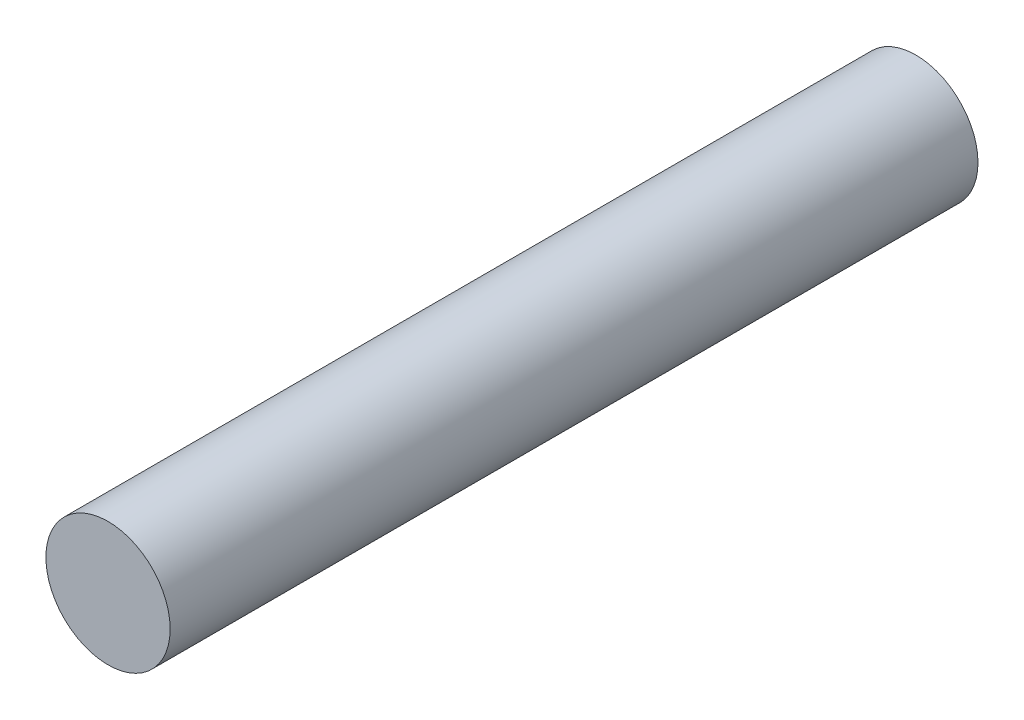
from build123d import *

# Parameters (mm, degrees)
ESQUISSE1_R      = 0.5
EXTRUSION1_DEPTH = 6.5


with BuildPart() as part:
    # Esquisse1 → Extrusion1 (new body)
    with BuildSketch(Plane.XY):
        Circle(ESQUISSE1_R)
    extrude(amount=EXTRUSION1_DEPTH)


solid = part.part
